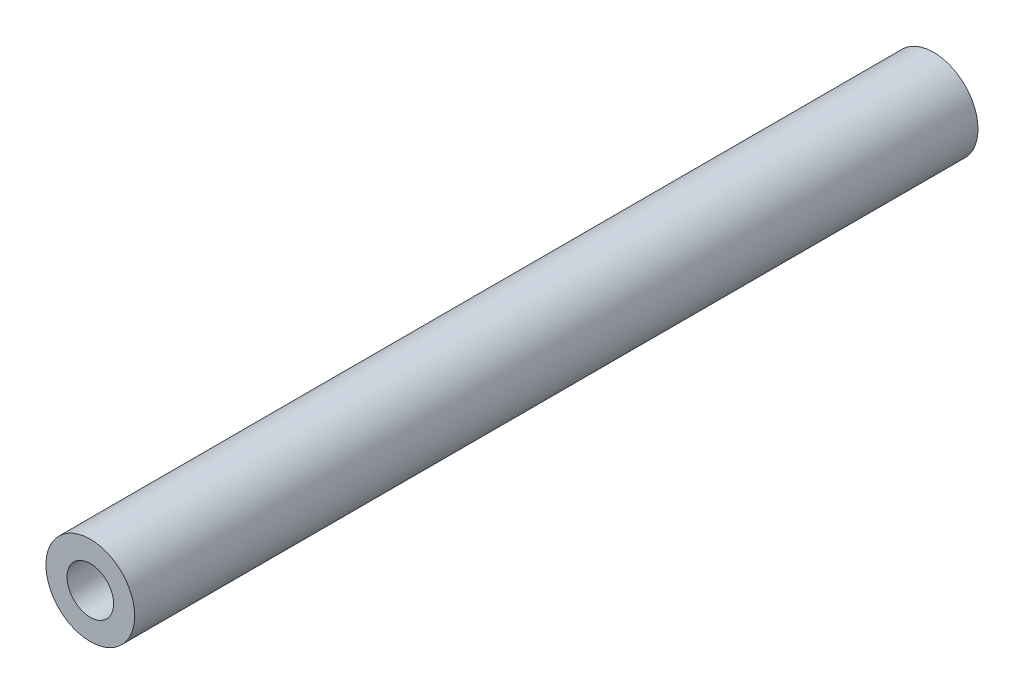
from build123d import *

# Parameters (mm, degrees)
ESQUISSE1_R           = 4
EXTRUSION1_DEPTH      = 38
TROU_TARAUD_M51_D     = 4.2
TROU_TARAUD_M51_DEPTH = 14.4
TROU_TARAUD_M51_TIP   = 1.2618073


with BuildPart() as part:
    # Esquisse1 → Extrusion1 (new body)
    with BuildSketch(Plane.XY):
        Circle(ESQUISSE1_R)
    extrude(amount=EXTRUSION1_DEPTH)

    # Trou taraud_ M51
    with Locations(Plane.XY.offset(38)):
        with Locations((0, 0)):
            Hole(TROU_TARAUD_M51_D / 2, depth=TROU_TARAUD_M51_DEPTH)
            with Locations((0, 0, -(TROU_TARAUD_M51_DEPTH + TROU_TARAUD_M51_TIP / 2))):  # 118° drill point
                Cone(0, TROU_TARAUD_M51_D / 2, TROU_TARAUD_M51_TIP, mode=Mode.SUBTRACT)

    # Sym_trie1: part across plane


with BuildPart() as part_1:
    add(part.part)
    add(part.part.mirror(Plane.XY))


solid = part_1.part
